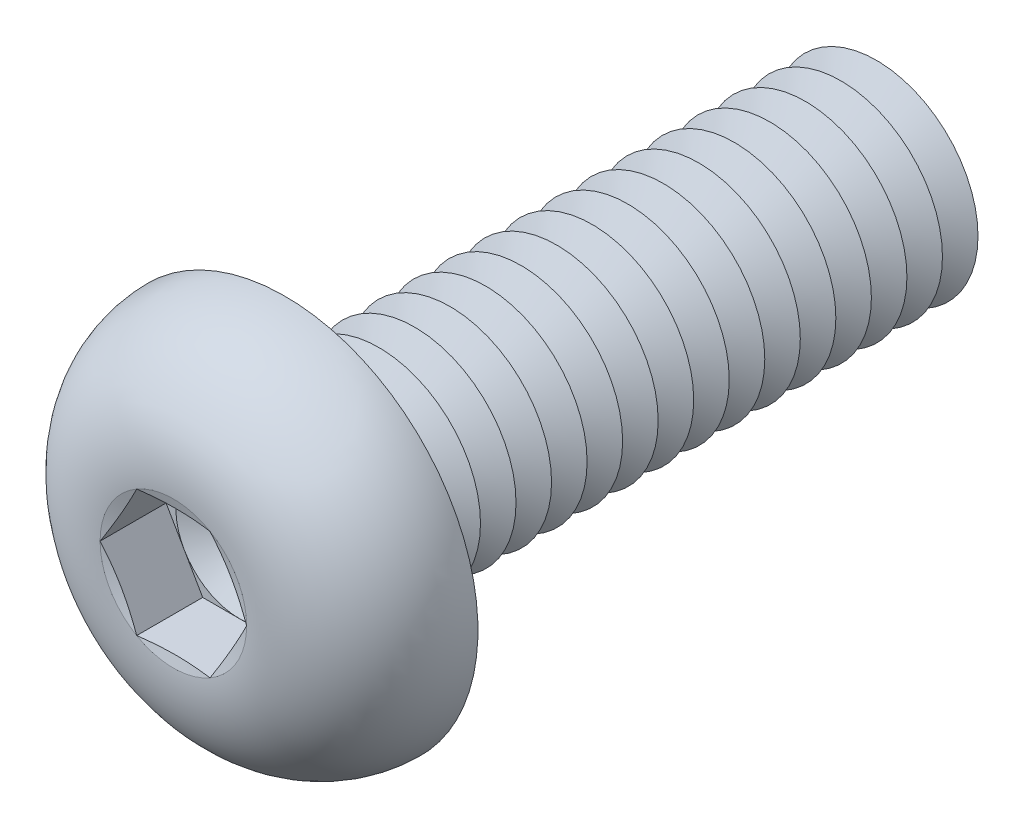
ISO-10303-21;
HEADER;
FILE_DESCRIPTION(('STEP AP214'),'2;1');
FILE_NAME('part.step','',(''),(''),'','','');
FILE_SCHEMA(('AUTOMOTIVE_DESIGN { 1 0 10303 214 1 1 1 1 }'));
ENDSEC;
DATA;
#1=APPLICATION_CONTEXT('core data for automotive mechanical design processes');
#2=APPLICATION_PROTOCOL_DEFINITION('international standard','automotive_design',2000,#1);
#3=PRODUCT_CONTEXT('',#1,'mechanical');
#4=PRODUCT('Part','Part','',(#3));
#5=PRODUCT_RELATED_PRODUCT_CATEGORY('part','',(#4));
#6=PRODUCT_DEFINITION_FORMATION('','',#4);
#7=PRODUCT_DEFINITION_CONTEXT('part definition',#1,'design');
#8=PRODUCT_DEFINITION('design','',#6,#7);
#9=PRODUCT_DEFINITION_SHAPE('','',#8);
#10=(LENGTH_UNIT() NAMED_UNIT(*) SI_UNIT(.MILLI.,.METRE.));
#11=(NAMED_UNIT(*) PLANE_ANGLE_UNIT() SI_UNIT($,.RADIAN.));
#12=(NAMED_UNIT(*) SI_UNIT($,.STERADIAN.) SOLID_ANGLE_UNIT());
#13=UNCERTAINTY_MEASURE_WITH_UNIT(LENGTH_MEASURE(1.E-05),#10,'distance_accuracy_value','');
#14=(GEOMETRIC_REPRESENTATION_CONTEXT(3) GLOBAL_UNCERTAINTY_ASSIGNED_CONTEXT((#13)) GLOBAL_UNIT_ASSIGNED_CONTEXT((#10,
#11,#12)) REPRESENTATION_CONTEXT('',''));
#15=CARTESIAN_POINT('',(0.,0.,0.));
#16=DIRECTION('',(0.,0.,1.));
#17=DIRECTION('',(1.,0.,0.));
#18=AXIS2_PLACEMENT_3D('',#15,#16,#17);
#19=CARTESIAN_POINT('',(0.,0.,0.9));
#20=DIRECTION('',(0.,0.,1.));
#21=DIRECTION('',(1.,0.,0.));
#22=AXIS2_PLACEMENT_3D('',#19,#20,#21);
#23=PLANE('',#22);
#24=CARTESIAN_POINT('',(0.,0.,0.9));
#25=DIRECTION('',(0.,0.,1.));
#26=DIRECTION('',(1.,0.,0.));
#27=AXIS2_PLACEMENT_3D('',#24,#25,#26);
#28=CIRCLE('',#27,1.24999941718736);
#29=CARTESIAN_POINT('',(1.08253125,0.624999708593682,0.9));
#30=VERTEX_POINT('',#29);
#31=CARTESIAN_POINT('',(0.,1.24999941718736,0.9));
#32=VERTEX_POINT('',#31);
#33=EDGE_CURVE('E118',#30,#32,#28,.T.);
#34=ORIENTED_EDGE('',*,*,#33,.F.);
#35=DIRECTION('',(-0.5,0.866025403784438,0.));
#36=VECTOR('',#35,1.);
#37=CARTESIAN_POINT('',(1.443375,0.,0.9));
#38=LINE('',#37,#36);
#39=CARTESIAN_POINT('',(0.7216875,1.24999941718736,0.9));
#40=VERTEX_POINT('',#39);
#41=EDGE_CURVE('E125',#30,#40,#38,.T.);
#42=ORIENTED_EDGE('',*,*,#41,.T.);
#43=DIRECTION('',(-1.,0.,0.));
#44=VECTOR('',#43,1.);
#45=CARTESIAN_POINT('',(0.7216875,1.24999941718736,0.9));
#46=LINE('',#45,#44);
#47=EDGE_CURVE('E136',#40,#32,#46,.T.);
#48=ORIENTED_EDGE('',*,*,#47,.T.);
#49=EDGE_LOOP('',(#34,#42,#48));
#50=FACE_BOUND('',#49,.T.);
#51=ADVANCED_FACE('F39',(#50),#23,.T.);
#52=CARTESIAN_POINT('',(0.,0.,0.9));
#53=DIRECTION('',(0.,0.,1.));
#54=DIRECTION('',(1.,0.,0.));
#55=AXIS2_PLACEMENT_3D('',#52,#53,#54);
#56=CIRCLE('',#55,1.24999941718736);
#57=CARTESIAN_POINT('',(-1.08253125,0.624999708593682,0.9));
#58=VERTEX_POINT('',#57);
#59=EDGE_CURVE('E11',#32,#58,#56,.T.);
#60=ORIENTED_EDGE('',*,*,#59,.F.);
#61=CARTESIAN_POINT('',(-0.721687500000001,1.24999941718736,0.9));
#62=VERTEX_POINT('',#61);
#63=EDGE_CURVE('E131',#32,#62,#46,.T.);
#64=ORIENTED_EDGE('',*,*,#63,.T.);
#65=DIRECTION('',(-0.5,-0.866025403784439,0.));
#66=VECTOR('',#65,1.);
#67=CARTESIAN_POINT('',(-0.721687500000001,1.24999941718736,0.9));
#68=LINE('',#67,#66);
#69=EDGE_CURVE('E134',#62,#58,#68,.T.);
#70=ORIENTED_EDGE('',*,*,#69,.T.);
#71=EDGE_LOOP('',(#60,#64,#70));
#72=FACE_BOUND('',#71,.T.);
#73=ADVANCED_FACE('F130',(#72),#23,.T.);
#74=CARTESIAN_POINT('',(-1.08253125,-0.624999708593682,0.9));
#75=VERTEX_POINT('',#74);
#76=EDGE_CURVE('E49',#58,#75,#56,.T.);
#77=ORIENTED_EDGE('',*,*,#76,.F.);
#78=CARTESIAN_POINT('',(-1.443375,0.,0.9));
#79=VERTEX_POINT('',#78);
#80=EDGE_CURVE('E143',#58,#79,#68,.T.);
#81=ORIENTED_EDGE('',*,*,#80,.T.);
#82=DIRECTION('',(0.5,-0.866025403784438,0.));
#83=VECTOR('',#82,1.);
#84=CARTESIAN_POINT('',(-1.443375,0.,0.9));
#85=LINE('',#84,#83);
#86=EDGE_CURVE('E151',#79,#75,#85,.T.);
#87=ORIENTED_EDGE('',*,*,#86,.T.);
#88=EDGE_LOOP('',(#77,#81,#87));
#89=FACE_BOUND('',#88,.T.);
#90=ADVANCED_FACE('F408',(#89),#23,.T.);
#91=CARTESIAN_POINT('',(0.,-1.24999941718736,0.9));
#92=VERTEX_POINT('',#91);
#93=EDGE_CURVE('E392',#75,#92,#56,.T.);
#94=ORIENTED_EDGE('',*,*,#93,.F.);
#95=CARTESIAN_POINT('',(-0.721687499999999,-1.24999941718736,0.9));
#96=VERTEX_POINT('',#95);
#97=EDGE_CURVE('E150',#75,#96,#85,.T.);
#98=ORIENTED_EDGE('',*,*,#97,.T.);
#99=DIRECTION('',(1.,0.,0.));
#100=VECTOR('',#99,1.);
#101=CARTESIAN_POINT('',(-0.721687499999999,-1.24999941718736,0.9));
#102=LINE('',#101,#100);
#103=EDGE_CURVE('E156',#96,#92,#102,.T.);
#104=ORIENTED_EDGE('',*,*,#103,.T.);
#105=EDGE_LOOP('',(#94,#98,#104));
#106=FACE_BOUND('',#105,.T.);
#107=ADVANCED_FACE('F402',(#106),#23,.T.);
#108=CARTESIAN_POINT('',(1.08253125,-0.624999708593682,0.9));
#109=VERTEX_POINT('',#108);
#110=EDGE_CURVE('E56',#92,#109,#56,.T.);
#111=ORIENTED_EDGE('',*,*,#110,.F.);
#112=CARTESIAN_POINT('',(0.721687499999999,-1.24999941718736,0.9));
#113=VERTEX_POINT('',#112);
#114=EDGE_CURVE('E155',#92,#113,#102,.T.);
#115=ORIENTED_EDGE('',*,*,#114,.T.);
#116=DIRECTION('',(0.5,0.866025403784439,0.));
#117=VECTOR('',#116,1.);
#118=CARTESIAN_POINT('',(0.721687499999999,-1.24999941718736,0.9));
#119=LINE('',#118,#117);
#120=EDGE_CURVE('E161',#113,#109,#119,.T.);
#121=ORIENTED_EDGE('',*,*,#120,.T.);
#122=EDGE_LOOP('',(#111,#115,#121));
#123=FACE_BOUND('',#122,.T.);
#124=ADVANCED_FACE('F450',(#123),#23,.T.);
#125=CARTESIAN_POINT('',(0.,0.,2.2));
#126=DIRECTION('',(0.,0.,1.));
#127=DIRECTION('',(1.,0.,0.));
#128=AXIS2_PLACEMENT_3D('',#125,#126,#127);
#129=CONICAL_SURFACE('',#128,1.443375,1.30899693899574);
#130=CARTESIAN_POINT('',(1.44349047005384,-0.000199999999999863,2.20003094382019));
#131=CARTESIAN_POINT('',(1.41351104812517,0.0517258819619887,2.19199301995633));
#132=CARTESIAN_POINT('',(1.38347725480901,0.10374593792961,2.18469579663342));
#133=CARTESIAN_POINT('',(1.32330355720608,0.207969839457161,2.17187512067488));
#134=CARTESIAN_POINT('',(1.29316361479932,0.260173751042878,2.16635238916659));
#135=CARTESIAN_POINT('',(1.23296043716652,0.364448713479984,2.15740323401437));
#136=CARTESIAN_POINT('',(1.20289760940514,0.416519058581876,2.15396613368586));
#137=CARTESIAN_POINT('',(1.14273359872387,0.520726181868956,2.14935732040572));
#138=CARTESIAN_POINT('',(1.11263242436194,0.572862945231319,2.14818516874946));
#139=CARTESIAN_POINT('',(1.05243007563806,0.677136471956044,2.14818516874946));
#140=CARTESIAN_POINT('',(1.02232890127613,0.729273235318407,2.14935732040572));
#141=CARTESIAN_POINT('',(0.962164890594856,0.833480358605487,2.15396613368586));
#142=CARTESIAN_POINT('',(0.932102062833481,0.885550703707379,2.15740323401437));
#143=CARTESIAN_POINT('',(0.87189888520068,0.989825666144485,2.16635238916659));
#144=CARTESIAN_POINT('',(0.841758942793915,1.0420295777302,2.17187512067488));
#145=CARTESIAN_POINT('',(0.781585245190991,1.14625347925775,2.18469579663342));
#146=CARTESIAN_POINT('',(0.751551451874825,1.19827353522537,2.19199301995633));
#147=CARTESIAN_POINT('',(0.721572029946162,1.25019941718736,2.20003094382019));
#148=B_SPLINE_CURVE_WITH_KNOTS('',3,(#130,#131,#132,#133,#134,#135,#136,#137,#138,#139,#140,
#141,#142,#143,#144,#145,#146,#147),.UNSPECIFIED.,.F.,.F.,(4,2,2,2,2,2,2,2,4),(0.,
0.181495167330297,0.363063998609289,0.543695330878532,0.724291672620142,0.904888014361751,
1.08551934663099,1.26708817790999,1.44858334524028),.UNSPECIFIED.);
#149=CARTESIAN_POINT('',(1.443375,0.,2.2));
#150=VERTEX_POINT('',#149);
#151=CARTESIAN_POINT('',(0.721687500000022,1.24999941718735,2.2));
#152=VERTEX_POINT('',#151);
#153=EDGE_CURVE('E221',#150,#152,#148,.T.);
#154=ORIENTED_EDGE('',*,*,#153,.F.);
#155=CARTESIAN_POINT('',(0.,0.,2.2));
#156=DIRECTION('',(0.,0.,-1.));
#157=DIRECTION('',(-1.,0.,0.));
#158=AXIS2_PLACEMENT_3D('',#155,#156,#157);
#159=CIRCLE('',#158,1.443375);
#160=EDGE_CURVE('E438',#152,#150,#159,.T.);
#161=ORIENTED_EDGE('',*,*,#160,.F.);
#162=EDGE_LOOP('',(#154,#161));
#163=FACE_BOUND('',#162,.T.);
#164=ADVANCED_FACE('F489',(#163),#129,.F.);
#165=CARTESIAN_POINT('',(0.721572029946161,-1.25019941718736,2.20003094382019));
#166=CARTESIAN_POINT('',(0.751551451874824,-1.19827353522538,2.19199301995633));
#167=CARTESIAN_POINT('',(0.78158524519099,-1.14625347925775,2.18469579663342));
#168=CARTESIAN_POINT('',(0.841758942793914,-1.0420295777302,2.17187512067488));
#169=CARTESIAN_POINT('',(0.87189888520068,-0.989825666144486,2.16635238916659));
#170=CARTESIAN_POINT('',(0.932102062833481,-0.88555070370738,2.15740323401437));
#171=CARTESIAN_POINT('',(0.962164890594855,-0.833480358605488,2.15396613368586));
#172=CARTESIAN_POINT('',(1.02232890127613,-0.729273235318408,2.14935732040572));
#173=CARTESIAN_POINT('',(1.05243007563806,-0.677136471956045,2.14818516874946));
#174=CARTESIAN_POINT('',(1.11263242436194,-0.572862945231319,2.14818516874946));
#175=CARTESIAN_POINT('',(1.14273359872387,-0.520726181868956,2.14935732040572));
#176=CARTESIAN_POINT('',(1.20289760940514,-0.416519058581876,2.15396613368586));
#177=CARTESIAN_POINT('',(1.23296043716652,-0.364448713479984,2.15740323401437));
#178=CARTESIAN_POINT('',(1.29316361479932,-0.260173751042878,2.16635238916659));
#179=CARTESIAN_POINT('',(1.32330355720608,-0.207969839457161,2.17187512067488));
#180=CARTESIAN_POINT('',(1.38347725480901,-0.10374593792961,2.18469579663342));
#181=CARTESIAN_POINT('',(1.41351104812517,-0.0517258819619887,2.19199301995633));
#182=CARTESIAN_POINT('',(1.44349047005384,0.000199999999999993,2.20003094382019));
#183=B_SPLINE_CURVE_WITH_KNOTS('',3,(#165,#166,#167,#168,#169,#170,#171,#172,#173,#174,#175,
#176,#177,#178,#179,#180,#181,#182),.UNSPECIFIED.,.F.,.F.,(4,2,2,2,2,2,2,2,4),(0.,
0.181495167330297,0.36306399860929,0.543695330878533,0.724291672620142,0.904888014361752,
1.085519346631,1.26708817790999,1.44858334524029),.UNSPECIFIED.);
#184=CARTESIAN_POINT('',(0.721687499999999,-1.24999941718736,2.2));
#185=VERTEX_POINT('',#184);
#186=EDGE_CURVE('E230',#185,#150,#183,.T.);
#187=ORIENTED_EDGE('',*,*,#186,.F.);
#188=EDGE_CURVE('E440',#150,#185,#159,.T.);
#189=ORIENTED_EDGE('',*,*,#188,.F.);
#190=EDGE_LOOP('',(#187,#189));
#191=FACE_BOUND('',#190,.T.);
#192=ADVANCED_FACE('F494',(#191),#129,.F.);
#193=CARTESIAN_POINT('',(-2.17815859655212,-1.24999941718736,2.48616275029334));
#194=CARTESIAN_POINT('',(-2.07269794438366,-1.24999941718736,2.4616881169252));
#195=CARTESIAN_POINT('',(-1.96714913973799,-1.24999941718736,2.43756889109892));
#196=CARTESIAN_POINT('',(-1.75576352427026,-1.24999941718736,2.39052699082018));
#197=CARTESIAN_POINT('',(-1.64992665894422,-1.24999941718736,2.36760456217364));
#198=CARTESIAN_POINT('',(-1.43690237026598,-1.24999941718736,2.3232454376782));
#199=CARTESIAN_POINT('',(-1.32971158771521,-1.24999941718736,2.30182468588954));
#200=CARTESIAN_POINT('',(-1.1148274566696,-1.24999941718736,2.26156703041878));
#201=CARTESIAN_POINT('',(-1.00713406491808,-1.24999941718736,2.24273035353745));
#202=CARTESIAN_POINT('',(-0.794044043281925,-1.24999941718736,2.2093913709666));
#203=CARTESIAN_POINT('',(-0.688664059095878,-1.24999941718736,2.19478562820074));
#204=CARTESIAN_POINT('',(-0.477310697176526,-1.24999941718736,2.17085809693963));
#205=CARTESIAN_POINT('',(-0.371337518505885,-1.24999941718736,2.16153463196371));
#206=CARTESIAN_POINT('',(-0.159455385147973,-1.24999941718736,2.14976770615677));
#207=CARTESIAN_POINT('',(-0.0535482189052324,-1.24999941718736,2.14729400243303));
#208=CARTESIAN_POINT('',(0.158189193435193,-1.24999941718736,2.14966287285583));
#209=CARTESIAN_POINT('',(0.264019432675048,-1.24999941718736,2.15450603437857));
#210=CARTESIAN_POINT('',(0.445148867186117,-1.24999941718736,2.16825380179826));
#211=CARTESIAN_POINT('',(0.520574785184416,-1.24999941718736,2.17561242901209));
#212=CARTESIAN_POINT('',(0.671115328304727,-1.24999941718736,2.19297000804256));
#213=CARTESIAN_POINT('',(0.746229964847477,-1.24999941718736,2.20296886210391));
#214=CARTESIAN_POINT('',(0.896387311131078,-1.24999941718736,2.22505910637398));
#215=CARTESIAN_POINT('',(0.971429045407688,-1.24999941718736,2.23715700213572));
#216=CARTESIAN_POINT('',(1.12124320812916,-1.24999941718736,2.26292371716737));
#217=CARTESIAN_POINT('',(1.19601562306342,-1.24999941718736,2.27659261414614));
#218=CARTESIAN_POINT('',(1.34686913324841,-1.24999941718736,2.30540811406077));
#219=CARTESIAN_POINT('',(1.42294548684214,-1.24999941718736,2.32057934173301));
#220=CARTESIAN_POINT('',(1.57490676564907,-1.24999941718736,2.351851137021));
#221=CARTESIAN_POINT('',(1.65079168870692,-1.24999941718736,2.36795171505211));
#222=CARTESIAN_POINT('',(1.80199501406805,-1.24999941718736,2.40076814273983));
#223=CARTESIAN_POINT('',(1.87731425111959,-1.24999941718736,2.41748016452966));
#224=CARTESIAN_POINT('',(2.02782424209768,-1.24999941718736,2.45144971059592));
#225=CARTESIAN_POINT('',(2.10301500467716,-1.24999941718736,2.46870719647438));
#226=CARTESIAN_POINT('',(2.17815859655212,-1.24999941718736,2.48616275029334));
#227=B_SPLINE_CURVE_WITH_KNOTS('',3,(#193,#194,#195,#196,#197,#198,#199,#200,#201,#202,#203,
#204,#205,#206,#207,#208,#209,#210,#211,#212,#213,#214,#215,#216,#217,#218,#219,#220,#221,#222,
#223,#224,#225,#226),.UNSPECIFIED.,.F.,.F.,(4,2,2,2,2,2,2,2,2,2,2,2,2,2,2,2,4),(0.,
0.324797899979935,0.649662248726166,0.977572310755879,1.30551113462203,1.62458166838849,
1.94355087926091,2.26110952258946,2.57869365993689,2.80599541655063,3.03328875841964,
3.2612995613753,3.48932164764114,3.7220371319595,3.95475522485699,4.18620606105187,
4.41764064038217),.UNSPECIFIED.);
#228=CARTESIAN_POINT('',(-0.721687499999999,-1.24999941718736,2.2));
#229=VERTEX_POINT('',#228);
#230=EDGE_CURVE('E420',#229,#185,#227,.T.);
#231=ORIENTED_EDGE('',*,*,#230,.F.);
#232=EDGE_CURVE('E428',#185,#229,#159,.T.);
#233=ORIENTED_EDGE('',*,*,#232,.F.);
#234=EDGE_LOOP('',(#231,#233));
#235=FACE_BOUND('',#234,.T.);
#236=ADVANCED_FACE('F548',(#235),#129,.F.);
#237=CARTESIAN_POINT('',(-1.44349047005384,0.000200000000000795,2.20003094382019));
#238=CARTESIAN_POINT('',(-1.41351104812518,-0.0517258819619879,2.19199301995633));
#239=CARTESIAN_POINT('',(-1.38347725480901,-0.10374593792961,2.18469579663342));
#240=CARTESIAN_POINT('',(-1.32330355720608,-0.20796983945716,2.17187512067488));
#241=CARTESIAN_POINT('',(-1.29316361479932,-0.260173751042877,2.16635238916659));
#242=CARTESIAN_POINT('',(-1.23296043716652,-0.364448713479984,2.15740323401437));
#243=CARTESIAN_POINT('',(-1.20289760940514,-0.416519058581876,2.15396613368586));
#244=CARTESIAN_POINT('',(-1.14273359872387,-0.520726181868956,2.14935732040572));
#245=CARTESIAN_POINT('',(-1.11263242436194,-0.572862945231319,2.14818516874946));
#246=CARTESIAN_POINT('',(-1.05243007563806,-0.677136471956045,2.14818516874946));
#247=CARTESIAN_POINT('',(-1.02232890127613,-0.729273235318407,2.14935732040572));
#248=CARTESIAN_POINT('',(-0.962164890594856,-0.833480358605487,2.15396613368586));
#249=CARTESIAN_POINT('',(-0.932102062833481,-0.885550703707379,2.15740323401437));
#250=CARTESIAN_POINT('',(-0.87189888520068,-0.989825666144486,2.16635238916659));
#251=CARTESIAN_POINT('',(-0.841758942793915,-1.0420295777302,2.17187512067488));
#252=CARTESIAN_POINT('',(-0.78158524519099,-1.14625347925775,2.18469579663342));
#253=CARTESIAN_POINT('',(-0.751551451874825,-1.19827353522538,2.19199301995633));
#254=CARTESIAN_POINT('',(-0.721572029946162,-1.25019941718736,2.20003094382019));
#255=B_SPLINE_CURVE_WITH_KNOTS('',3,(#237,#238,#239,#240,#241,#242,#243,#244,#245,#246,#247,
#248,#249,#250,#251,#252,#253,#254),.UNSPECIFIED.,.F.,.F.,(4,2,2,2,2,2,2,2,4),(0.,
0.181495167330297,0.36306399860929,0.543695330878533,0.724291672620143,0.904888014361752,
1.085519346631,1.26708817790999,1.44858334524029),.UNSPECIFIED.);
#256=CARTESIAN_POINT('',(-1.443375,0.,2.2));
#257=VERTEX_POINT('',#256);
#258=EDGE_CURVE('E413',#257,#229,#255,.T.);
#259=ORIENTED_EDGE('',*,*,#258,.F.);
#260=EDGE_CURVE('E371',#229,#257,#159,.T.);
#261=ORIENTED_EDGE('',*,*,#260,.F.);
#262=EDGE_LOOP('',(#259,#261));
#263=FACE_BOUND('',#262,.T.);
#264=ADVANCED_FACE('F417',(#263),#129,.F.);
#265=CARTESIAN_POINT('',(-0.721572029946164,1.25019941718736,2.20003094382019));
#266=CARTESIAN_POINT('',(-0.751551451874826,1.19827353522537,2.19199301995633));
#267=CARTESIAN_POINT('',(-0.781585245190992,1.14625347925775,2.18469579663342));
#268=CARTESIAN_POINT('',(-0.841758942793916,1.0420295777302,2.17187512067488));
#269=CARTESIAN_POINT('',(-0.871898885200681,0.989825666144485,2.16635238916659));
#270=CARTESIAN_POINT('',(-0.932102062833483,0.885550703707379,2.15740323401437));
#271=CARTESIAN_POINT('',(-0.962164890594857,0.833480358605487,2.15396613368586));
#272=CARTESIAN_POINT('',(-1.02232890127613,0.729273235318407,2.14935732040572));
#273=CARTESIAN_POINT('',(-1.05243007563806,0.677136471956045,2.14818516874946));
#274=CARTESIAN_POINT('',(-1.11263242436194,0.572862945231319,2.14818516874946));
#275=CARTESIAN_POINT('',(-1.14273359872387,0.520726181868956,2.14935732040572));
#276=CARTESIAN_POINT('',(-1.20289760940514,0.416519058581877,2.15396613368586));
#277=CARTESIAN_POINT('',(-1.23296043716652,0.364448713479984,2.15740323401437));
#278=CARTESIAN_POINT('',(-1.29316361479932,0.260173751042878,2.16635238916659));
#279=CARTESIAN_POINT('',(-1.32330355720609,0.207969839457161,2.17187512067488));
#280=CARTESIAN_POINT('',(-1.38347725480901,0.103745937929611,2.18469579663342));
#281=CARTESIAN_POINT('',(-1.41351104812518,0.0517258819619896,2.19199301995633));
#282=CARTESIAN_POINT('',(-1.44349047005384,-0.00019999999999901,2.20003094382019));
#283=B_SPLINE_CURVE_WITH_KNOTS('',3,(#265,#266,#267,#268,#269,#270,#271,#272,#273,#274,#275,
#276,#277,#278,#279,#280,#281,#282),.UNSPECIFIED.,.F.,.F.,(4,2,2,2,2,2,2,2,4),(0.,
0.181495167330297,0.363063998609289,0.543695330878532,0.724291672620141,0.90488801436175,
1.08551934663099,1.26708817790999,1.44858334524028),.UNSPECIFIED.);
#284=CARTESIAN_POINT('',(-0.721687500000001,1.24999941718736,2.2));
#285=VERTEX_POINT('',#284);
#286=EDGE_CURVE('E194',#285,#257,#283,.T.);
#287=ORIENTED_EDGE('',*,*,#286,.F.);
#288=EDGE_CURVE('E372',#257,#285,#159,.T.);
#289=ORIENTED_EDGE('',*,*,#288,.F.);
#290=EDGE_LOOP('',(#287,#289));
#291=FACE_BOUND('',#290,.T.);
#292=ADVANCED_FACE('F430',(#291),#129,.F.);
#293=CARTESIAN_POINT('',(0.,0.,-9.55));
#294=DIRECTION('',(0.,0.,1.));
#295=DIRECTION('',(1.,0.,0.));
#296=AXIS2_PLACEMENT_3D('',#293,#294,#295);
#297=CONICAL_SURFACE('',#296,2.00000000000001,1.0471975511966);
#298=CARTESIAN_POINT('',(0.,0.,-9.9));
#299=DIRECTION('',(0.,0.,1.));
#300=DIRECTION('',(1.,0.,0.));
#301=AXIS2_PLACEMENT_3D('',#298,#299,#300);
#302=CIRCLE('',#301,1.3937822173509);
#303=CARTESIAN_POINT('',(1.3937822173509,0.,-9.9));
#304=VERTEX_POINT('',#303);
#305=EDGE_CURVE('E343',#304,#304,#302,.T.);
#306=ORIENTED_EDGE('',*,*,#305,.T.);
#307=EDGE_LOOP('',(#306));
#308=FACE_BOUND('',#307,.T.);
#309=CARTESIAN_POINT('',(0.,0.,-9.55));
#310=DIRECTION('',(0.,0.,1.));
#311=DIRECTION('',(1.,0.,0.));
#312=AXIS2_PLACEMENT_3D('',#309,#310,#311);
#313=CIRCLE('',#312,2.00000000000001);
#314=CARTESIAN_POINT('',(2.00000000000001,0.,-9.55));
#315=VERTEX_POINT('',#314);
#316=EDGE_CURVE('E339',#315,#315,#313,.T.);
#317=ORIENTED_EDGE('',*,*,#316,.F.);
#318=EDGE_LOOP('',(#317));
#319=FACE_BOUND('',#318,.T.);
#320=ADVANCED_FACE('F538',(#308,#319),#297,.T.);
#321=CARTESIAN_POINT('',(0.,0.,-9.9));
#322=DIRECTION('',(0.,0.,-1.));
#323=DIRECTION('',(-1.,0.,0.));
#324=AXIS2_PLACEMENT_3D('',#321,#322,#323);
#325=CONICAL_SURFACE('',#324,1.3937822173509,1.0471975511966);
#326=CARTESIAN_POINT('',(0.,0.,-10.25));
#327=DIRECTION('',(0.,0.,1.));
#328=DIRECTION('',(1.,0.,0.));
#329=AXIS2_PLACEMENT_3D('',#326,#327,#328);
#330=CIRCLE('',#329,2.00000000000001);
#331=CARTESIAN_POINT('',(2.00000000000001,0.,-10.25));
#332=VERTEX_POINT('',#331);
#333=EDGE_CURVE('E347',#332,#332,#330,.T.);
#334=ORIENTED_EDGE('',*,*,#333,.T.);
#335=EDGE_LOOP('',(#334));
#336=FACE_BOUND('',#335,.T.);
#337=ORIENTED_EDGE('',*,*,#305,.F.);
#338=EDGE_LOOP('',(#337));
#339=FACE_BOUND('',#338,.T.);
#340=ADVANCED_FACE('F884',(#336,#339),#325,.T.);
#341=CARTESIAN_POINT('',(0.,2.00000000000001,-12.));
#342=DIRECTION('',(0.,0.,-1.));
#343=DIRECTION('',(-1.,0.,0.));
#344=AXIS2_PLACEMENT_3D('',#341,#342,#343);
#345=PLANE('',#344);
#346=CARTESIAN_POINT('',(0.,0.,-12.));
#347=DIRECTION('',(0.,0.,1.));
#348=DIRECTION('',(1.,0.,0.));
#349=AXIS2_PLACEMENT_3D('',#346,#347,#348);
#350=CIRCLE('',#349,1.3937822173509);
#351=CARTESIAN_POINT('',(1.3937822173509,0.,-12.));
#352=VERTEX_POINT('',#351);
#353=EDGE_CURVE('E367',#352,#352,#350,.T.);
#354=ORIENTED_EDGE('',*,*,#353,.F.);
#355=EDGE_LOOP('',(#354));
#356=FACE_BOUND('',#355,.T.);
#357=ADVANCED_FACE('F889',(#356),#345,.T.);
#358=CARTESIAN_POINT('',(0.,0.,-11.65));
#359=DIRECTION('',(0.,0.,1.));
#360=DIRECTION('',(1.,0.,0.));
#361=AXIS2_PLACEMENT_3D('',#358,#359,#360);
#362=CONICAL_SURFACE('',#361,2.00000000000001,1.0471975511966);
#363=ORIENTED_EDGE('',*,*,#353,.T.);
#364=EDGE_LOOP('',(#363));
#365=FACE_BOUND('',#364,.T.);
#366=CARTESIAN_POINT('',(0.,0.,-11.65));
#367=DIRECTION('',(0.,0.,1.));
#368=DIRECTION('',(1.,0.,0.));
#369=AXIS2_PLACEMENT_3D('',#366,#367,#368);
#370=CIRCLE('',#369,2.00000000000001);
#371=CARTESIAN_POINT('',(2.00000000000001,0.,-11.65));
#372=VERTEX_POINT('',#371);
#373=EDGE_CURVE('E363',#372,#372,#370,.T.);
#374=ORIENTED_EDGE('',*,*,#373,.F.);
#375=EDGE_LOOP('',(#374));
#376=FACE_BOUND('',#375,.T.);
#377=ADVANCED_FACE('F877',(#365,#376),#362,.T.);
#378=CARTESIAN_POINT('',(0.,0.,-11.3));
#379=DIRECTION('',(0.,0.,-1.));
#380=DIRECTION('',(-1.,0.,0.));
#381=AXIS2_PLACEMENT_3D('',#378,#379,#380);
#382=CONICAL_SURFACE('',#381,1.3937822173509,1.0471975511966);
#383=ORIENTED_EDGE('',*,*,#373,.T.);
#384=EDGE_LOOP('',(#383));
#385=FACE_BOUND('',#384,.T.);
#386=CARTESIAN_POINT('',(0.,0.,-11.3));
#387=DIRECTION('',(0.,0.,1.));
#388=DIRECTION('',(1.,0.,0.));
#389=AXIS2_PLACEMENT_3D('',#386,#387,#388);
#390=CIRCLE('',#389,1.3937822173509);
#391=CARTESIAN_POINT('',(1.3937822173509,0.,-11.3));
#392=VERTEX_POINT('',#391);
#393=EDGE_CURVE('E359',#392,#392,#390,.T.);
#394=ORIENTED_EDGE('',*,*,#393,.F.);
#395=EDGE_LOOP('',(#394));
#396=FACE_BOUND('',#395,.T.);
#397=ADVANCED_FACE('F867',(#385,#396),#382,.T.);
#398=CARTESIAN_POINT('',(0.,0.,-10.95));
#399=DIRECTION('',(0.,0.,1.));
#400=DIRECTION('',(1.,0.,0.));
#401=AXIS2_PLACEMENT_3D('',#398,#399,#400);
#402=CONICAL_SURFACE('',#401,2.00000000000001,1.0471975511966);
#403=ORIENTED_EDGE('',*,*,#393,.T.);
#404=EDGE_LOOP('',(#403));
#405=FACE_BOUND('',#404,.T.);
#406=CARTESIAN_POINT('',(0.,0.,-10.95));
#407=DIRECTION('',(0.,0.,1.));
#408=DIRECTION('',(1.,0.,0.));
#409=AXIS2_PLACEMENT_3D('',#406,#407,#408);
#410=CIRCLE('',#409,2.00000000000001);
#411=CARTESIAN_POINT('',(2.00000000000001,0.,-10.95));
#412=VERTEX_POINT('',#411);
#413=EDGE_CURVE('E355',#412,#412,#410,.T.);
#414=ORIENTED_EDGE('',*,*,#413,.F.);
#415=EDGE_LOOP('',(#414));
#416=FACE_BOUND('',#415,.T.);
#417=ADVANCED_FACE('F857',(#405,#416),#402,.T.);
#418=CARTESIAN_POINT('',(0.,0.,-10.6));
#419=DIRECTION('',(0.,0.,-1.));
#420=DIRECTION('',(-1.,0.,0.));
#421=AXIS2_PLACEMENT_3D('',#418,#419,#420);
#422=CONICAL_SURFACE('',#421,1.3937822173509,1.0471975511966);
#423=ORIENTED_EDGE('',*,*,#413,.T.);
#424=EDGE_LOOP('',(#423));
#425=FACE_BOUND('',#424,.T.);
#426=CARTESIAN_POINT('',(0.,0.,-10.6));
#427=DIRECTION('',(0.,0.,1.));
#428=DIRECTION('',(1.,0.,0.));
#429=AXIS2_PLACEMENT_3D('',#426,#427,#428);
#430=CIRCLE('',#429,1.3937822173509);
#431=CARTESIAN_POINT('',(1.3937822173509,0.,-10.6));
#432=VERTEX_POINT('',#431);
#433=EDGE_CURVE('E351',#432,#432,#430,.T.);
#434=ORIENTED_EDGE('',*,*,#433,.F.);
#435=EDGE_LOOP('',(#434));
#436=FACE_BOUND('',#435,.T.);
#437=ADVANCED_FACE('F847',(#425,#436),#422,.T.);
#438=CARTESIAN_POINT('',(0.,0.,-10.25));
#439=DIRECTION('',(0.,0.,1.));
#440=DIRECTION('',(1.,0.,0.));
#441=AXIS2_PLACEMENT_3D('',#438,#439,#440);
#442=CONICAL_SURFACE('',#441,2.00000000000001,1.0471975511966);
#443=ORIENTED_EDGE('',*,*,#433,.T.);
#444=EDGE_LOOP('',(#443));
#445=FACE_BOUND('',#444,.T.);
#446=ORIENTED_EDGE('',*,*,#333,.F.);
#447=EDGE_LOOP('',(#446));
#448=FACE_BOUND('',#447,.T.);
#449=ADVANCED_FACE('F837',(#445,#448),#442,.T.);
#450=CARTESIAN_POINT('',(0.,0.,-8.85));
#451=DIRECTION('',(0.,0.,1.));
#452=DIRECTION('',(1.,0.,0.));
#453=AXIS2_PLACEMENT_3D('',#450,#451,#452);
#454=CONICAL_SURFACE('',#453,2.00000000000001,1.0471975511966);
#455=CARTESIAN_POINT('',(0.,0.,-9.2));
#456=DIRECTION('',(0.,0.,1.));
#457=DIRECTION('',(1.,0.,0.));
#458=AXIS2_PLACEMENT_3D('',#455,#456,#457);
#459=CIRCLE('',#458,1.3937822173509);
#460=CARTESIAN_POINT('',(1.3937822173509,0.,-9.2));
#461=VERTEX_POINT('',#460);
#462=EDGE_CURVE('E335',#461,#461,#459,.T.);
#463=ORIENTED_EDGE('',*,*,#462,.T.);
#464=EDGE_LOOP('',(#463));
#465=FACE_BOUND('',#464,.T.);
#466=CARTESIAN_POINT('',(0.,0.,-8.85));
#467=DIRECTION('',(0.,0.,1.));
#468=DIRECTION('',(1.,0.,0.));
#469=AXIS2_PLACEMENT_3D('',#466,#467,#468);
#470=CIRCLE('',#469,2.00000000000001);
#471=CARTESIAN_POINT('',(2.00000000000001,0.,-8.85));
#472=VERTEX_POINT('',#471);
#473=EDGE_CURVE('E331',#472,#472,#470,.T.);
#474=ORIENTED_EDGE('',*,*,#473,.F.);
#475=EDGE_LOOP('',(#474));
#476=FACE_BOUND('',#475,.T.);
#477=ADVANCED_FACE('F827',(#465,#476),#454,.T.);
#478=CARTESIAN_POINT('',(0.,0.,-9.2));
#479=DIRECTION('',(0.,0.,-1.));
#480=DIRECTION('',(-1.,0.,0.));
#481=AXIS2_PLACEMENT_3D('',#478,#479,#480);
#482=CONICAL_SURFACE('',#481,1.3937822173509,1.0471975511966);
#483=ORIENTED_EDGE('',*,*,#316,.T.);
#484=EDGE_LOOP('',(#483));
#485=FACE_BOUND('',#484,.T.);
#486=ORIENTED_EDGE('',*,*,#462,.F.);
#487=EDGE_LOOP('',(#486));
#488=FACE_BOUND('',#487,.T.);
#489=ADVANCED_FACE('F817',(#485,#488),#482,.T.);
#490=CARTESIAN_POINT('',(0.,0.,-8.15));
#491=DIRECTION('',(0.,0.,1.));
#492=DIRECTION('',(1.,0.,0.));
#493=AXIS2_PLACEMENT_3D('',#490,#491,#492);
#494=CONICAL_SURFACE('',#493,2.00000000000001,1.0471975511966);
#495=CARTESIAN_POINT('',(0.,0.,-8.5));
#496=DIRECTION('',(0.,0.,1.));
#497=DIRECTION('',(1.,0.,0.));
#498=AXIS2_PLACEMENT_3D('',#495,#496,#497);
#499=CIRCLE('',#498,1.3937822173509);
#500=CARTESIAN_POINT('',(1.3937822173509,0.,-8.5));
#501=VERTEX_POINT('',#500);
#502=EDGE_CURVE('E327',#501,#501,#499,.T.);
#503=ORIENTED_EDGE('',*,*,#502,.T.);
#504=EDGE_LOOP('',(#503));
#505=FACE_BOUND('',#504,.T.);
#506=CARTESIAN_POINT('',(0.,0.,-8.15));
#507=DIRECTION('',(0.,0.,1.));
#508=DIRECTION('',(1.,0.,0.));
#509=AXIS2_PLACEMENT_3D('',#506,#507,#508);
#510=CIRCLE('',#509,2.00000000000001);
#511=CARTESIAN_POINT('',(2.00000000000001,0.,-8.15));
#512=VERTEX_POINT('',#511);
#513=EDGE_CURVE('E323',#512,#512,#510,.T.);
#514=ORIENTED_EDGE('',*,*,#513,.F.);
#515=EDGE_LOOP('',(#514));
#516=FACE_BOUND('',#515,.T.);
#517=ADVANCED_FACE('F807',(#505,#516),#494,.T.);
#518=CARTESIAN_POINT('',(0.,0.,-8.5));
#519=DIRECTION('',(0.,0.,-1.));
#520=DIRECTION('',(-1.,0.,0.));
#521=AXIS2_PLACEMENT_3D('',#518,#519,#520);
#522=CONICAL_SURFACE('',#521,1.3937822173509,1.0471975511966);
#523=ORIENTED_EDGE('',*,*,#473,.T.);
#524=EDGE_LOOP('',(#523));
#525=FACE_BOUND('',#524,.T.);
#526=ORIENTED_EDGE('',*,*,#502,.F.);
#527=EDGE_LOOP('',(#526));
#528=FACE_BOUND('',#527,.T.);
#529=ADVANCED_FACE('F797',(#525,#528),#522,.T.);
#530=CARTESIAN_POINT('',(0.,0.,-7.45));
#531=DIRECTION('',(0.,0.,1.));
#532=DIRECTION('',(1.,0.,0.));
#533=AXIS2_PLACEMENT_3D('',#530,#531,#532);
#534=CONICAL_SURFACE('',#533,2.00000000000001,1.0471975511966);
#535=CARTESIAN_POINT('',(0.,0.,-7.8));
#536=DIRECTION('',(0.,0.,1.));
#537=DIRECTION('',(1.,0.,0.));
#538=AXIS2_PLACEMENT_3D('',#535,#536,#537);
#539=CIRCLE('',#538,1.3937822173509);
#540=CARTESIAN_POINT('',(1.3937822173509,0.,-7.8));
#541=VERTEX_POINT('',#540);
#542=EDGE_CURVE('E319',#541,#541,#539,.T.);
#543=ORIENTED_EDGE('',*,*,#542,.T.);
#544=EDGE_LOOP('',(#543));
#545=FACE_BOUND('',#544,.T.);
#546=CARTESIAN_POINT('',(0.,0.,-7.45));
#547=DIRECTION('',(0.,0.,1.));
#548=DIRECTION('',(1.,0.,0.));
#549=AXIS2_PLACEMENT_3D('',#546,#547,#548);
#550=CIRCLE('',#549,2.00000000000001);
#551=CARTESIAN_POINT('',(2.00000000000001,0.,-7.45));
#552=VERTEX_POINT('',#551);
#553=EDGE_CURVE('E315',#552,#552,#550,.T.);
#554=ORIENTED_EDGE('',*,*,#553,.F.);
#555=EDGE_LOOP('',(#554));
#556=FACE_BOUND('',#555,.T.);
#557=ADVANCED_FACE('F787',(#545,#556),#534,.T.);
#558=CARTESIAN_POINT('',(0.,0.,-7.8));
#559=DIRECTION('',(0.,0.,-1.));
#560=DIRECTION('',(-1.,0.,0.));
#561=AXIS2_PLACEMENT_3D('',#558,#559,#560);
#562=CONICAL_SURFACE('',#561,1.3937822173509,1.0471975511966);
#563=ORIENTED_EDGE('',*,*,#513,.T.);
#564=EDGE_LOOP('',(#563));
#565=FACE_BOUND('',#564,.T.);
#566=ORIENTED_EDGE('',*,*,#542,.F.);
#567=EDGE_LOOP('',(#566));
#568=FACE_BOUND('',#567,.T.);
#569=ADVANCED_FACE('F777',(#565,#568),#562,.T.);
#570=CARTESIAN_POINT('',(0.,0.,-6.75));
#571=DIRECTION('',(0.,0.,1.));
#572=DIRECTION('',(1.,0.,0.));
#573=AXIS2_PLACEMENT_3D('',#570,#571,#572);
#574=CONICAL_SURFACE('',#573,2.00000000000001,1.0471975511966);
#575=CARTESIAN_POINT('',(0.,0.,-7.1));
#576=DIRECTION('',(0.,0.,1.));
#577=DIRECTION('',(1.,0.,0.));
#578=AXIS2_PLACEMENT_3D('',#575,#576,#577);
#579=CIRCLE('',#578,1.3937822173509);
#580=CARTESIAN_POINT('',(1.3937822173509,0.,-7.1));
#581=VERTEX_POINT('',#580);
#582=EDGE_CURVE('E311',#581,#581,#579,.T.);
#583=ORIENTED_EDGE('',*,*,#582,.T.);
#584=EDGE_LOOP('',(#583));
#585=FACE_BOUND('',#584,.T.);
#586=CARTESIAN_POINT('',(0.,0.,-6.75));
#587=DIRECTION('',(0.,0.,1.));
#588=DIRECTION('',(1.,0.,0.));
#589=AXIS2_PLACEMENT_3D('',#586,#587,#588);
#590=CIRCLE('',#589,2.00000000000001);
#591=CARTESIAN_POINT('',(2.00000000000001,0.,-6.75));
#592=VERTEX_POINT('',#591);
#593=EDGE_CURVE('E307',#592,#592,#590,.T.);
#594=ORIENTED_EDGE('',*,*,#593,.F.);
#595=EDGE_LOOP('',(#594));
#596=FACE_BOUND('',#595,.T.);
#597=ADVANCED_FACE('F767',(#585,#596),#574,.T.);
#598=CARTESIAN_POINT('',(0.,0.,-7.1));
#599=DIRECTION('',(0.,0.,-1.));
#600=DIRECTION('',(-1.,0.,0.));
#601=AXIS2_PLACEMENT_3D('',#598,#599,#600);
#602=CONICAL_SURFACE('',#601,1.3937822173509,1.0471975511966);
#603=ORIENTED_EDGE('',*,*,#553,.T.);
#604=EDGE_LOOP('',(#603));
#605=FACE_BOUND('',#604,.T.);
#606=ORIENTED_EDGE('',*,*,#582,.F.);
#607=EDGE_LOOP('',(#606));
#608=FACE_BOUND('',#607,.T.);
#609=ADVANCED_FACE('F757',(#605,#608),#602,.T.);
#610=CARTESIAN_POINT('',(0.,0.,-6.05));
#611=DIRECTION('',(0.,0.,1.));
#612=DIRECTION('',(1.,0.,0.));
#613=AXIS2_PLACEMENT_3D('',#610,#611,#612);
#614=CONICAL_SURFACE('',#613,2.00000000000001,1.0471975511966);
#615=CARTESIAN_POINT('',(0.,0.,-6.4));
#616=DIRECTION('',(0.,0.,1.));
#617=DIRECTION('',(1.,0.,0.));
#618=AXIS2_PLACEMENT_3D('',#615,#616,#617);
#619=CIRCLE('',#618,1.3937822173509);
#620=CARTESIAN_POINT('',(1.3937822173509,0.,-6.4));
#621=VERTEX_POINT('',#620);
#622=EDGE_CURVE('E303',#621,#621,#619,.T.);
#623=ORIENTED_EDGE('',*,*,#622,.T.);
#624=EDGE_LOOP('',(#623));
#625=FACE_BOUND('',#624,.T.);
#626=CARTESIAN_POINT('',(0.,0.,-6.05));
#627=DIRECTION('',(0.,0.,1.));
#628=DIRECTION('',(1.,0.,0.));
#629=AXIS2_PLACEMENT_3D('',#626,#627,#628);
#630=CIRCLE('',#629,2.00000000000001);
#631=CARTESIAN_POINT('',(2.00000000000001,0.,-6.05));
#632=VERTEX_POINT('',#631);
#633=EDGE_CURVE('E299',#632,#632,#630,.T.);
#634=ORIENTED_EDGE('',*,*,#633,.F.);
#635=EDGE_LOOP('',(#634));
#636=FACE_BOUND('',#635,.T.);
#637=ADVANCED_FACE('F747',(#625,#636),#614,.T.);
#638=CARTESIAN_POINT('',(0.,0.,-6.4));
#639=DIRECTION('',(0.,0.,-1.));
#640=DIRECTION('',(-1.,0.,0.));
#641=AXIS2_PLACEMENT_3D('',#638,#639,#640);
#642=CONICAL_SURFACE('',#641,1.3937822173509,1.0471975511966);
#643=ORIENTED_EDGE('',*,*,#593,.T.);
#644=EDGE_LOOP('',(#643));
#645=FACE_BOUND('',#644,.T.);
#646=ORIENTED_EDGE('',*,*,#622,.F.);
#647=EDGE_LOOP('',(#646));
#648=FACE_BOUND('',#647,.T.);
#649=ADVANCED_FACE('F737',(#645,#648),#642,.T.);
#650=CARTESIAN_POINT('',(0.,0.,-5.35));
#651=DIRECTION('',(0.,0.,1.));
#652=DIRECTION('',(1.,0.,0.));
#653=AXIS2_PLACEMENT_3D('',#650,#651,#652);
#654=CONICAL_SURFACE('',#653,2.00000000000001,1.0471975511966);
#655=CARTESIAN_POINT('',(0.,0.,-5.7));
#656=DIRECTION('',(0.,0.,1.));
#657=DIRECTION('',(1.,0.,0.));
#658=AXIS2_PLACEMENT_3D('',#655,#656,#657);
#659=CIRCLE('',#658,1.3937822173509);
#660=CARTESIAN_POINT('',(1.3937822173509,0.,-5.7));
#661=VERTEX_POINT('',#660);
#662=EDGE_CURVE('E295',#661,#661,#659,.T.);
#663=ORIENTED_EDGE('',*,*,#662,.T.);
#664=EDGE_LOOP('',(#663));
#665=FACE_BOUND('',#664,.T.);
#666=CARTESIAN_POINT('',(0.,0.,-5.35));
#667=DIRECTION('',(0.,0.,1.));
#668=DIRECTION('',(1.,0.,0.));
#669=AXIS2_PLACEMENT_3D('',#666,#667,#668);
#670=CIRCLE('',#669,2.00000000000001);
#671=CARTESIAN_POINT('',(2.00000000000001,0.,-5.35));
#672=VERTEX_POINT('',#671);
#673=EDGE_CURVE('E291',#672,#672,#670,.T.);
#674=ORIENTED_EDGE('',*,*,#673,.F.);
#675=EDGE_LOOP('',(#674));
#676=FACE_BOUND('',#675,.T.);
#677=ADVANCED_FACE('F727',(#665,#676),#654,.T.);
#678=CARTESIAN_POINT('',(0.,0.,-5.7));
#679=DIRECTION('',(0.,0.,-1.));
#680=DIRECTION('',(-1.,0.,0.));
#681=AXIS2_PLACEMENT_3D('',#678,#679,#680);
#682=CONICAL_SURFACE('',#681,1.3937822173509,1.0471975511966);
#683=ORIENTED_EDGE('',*,*,#633,.T.);
#684=EDGE_LOOP('',(#683));
#685=FACE_BOUND('',#684,.T.);
#686=ORIENTED_EDGE('',*,*,#662,.F.);
#687=EDGE_LOOP('',(#686));
#688=FACE_BOUND('',#687,.T.);
#689=ADVANCED_FACE('F717',(#685,#688),#682,.T.);
#690=CARTESIAN_POINT('',(0.,0.,-4.65));
#691=DIRECTION('',(0.,0.,1.));
#692=DIRECTION('',(1.,0.,0.));
#693=AXIS2_PLACEMENT_3D('',#690,#691,#692);
#694=CONICAL_SURFACE('',#693,2.00000000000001,1.0471975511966);
#695=CARTESIAN_POINT('',(0.,0.,-5.));
#696=DIRECTION('',(0.,0.,1.));
#697=DIRECTION('',(1.,0.,0.));
#698=AXIS2_PLACEMENT_3D('',#695,#696,#697);
#699=CIRCLE('',#698,1.3937822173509);
#700=CARTESIAN_POINT('',(1.3937822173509,0.,-5.));
#701=VERTEX_POINT('',#700);
#702=EDGE_CURVE('E287',#701,#701,#699,.T.);
#703=ORIENTED_EDGE('',*,*,#702,.T.);
#704=EDGE_LOOP('',(#703));
#705=FACE_BOUND('',#704,.T.);
#706=CARTESIAN_POINT('',(0.,0.,-4.65));
#707=DIRECTION('',(0.,0.,1.));
#708=DIRECTION('',(1.,0.,0.));
#709=AXIS2_PLACEMENT_3D('',#706,#707,#708);
#710=CIRCLE('',#709,2.00000000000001);
#711=CARTESIAN_POINT('',(2.00000000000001,0.,-4.65));
#712=VERTEX_POINT('',#711);
#713=EDGE_CURVE('E283',#712,#712,#710,.T.);
#714=ORIENTED_EDGE('',*,*,#713,.F.);
#715=EDGE_LOOP('',(#714));
#716=FACE_BOUND('',#715,.T.);
#717=ADVANCED_FACE('F707',(#705,#716),#694,.T.);
#718=CARTESIAN_POINT('',(0.,0.,-5.));
#719=DIRECTION('',(0.,0.,-1.));
#720=DIRECTION('',(-1.,0.,0.));
#721=AXIS2_PLACEMENT_3D('',#718,#719,#720);
#722=CONICAL_SURFACE('',#721,1.3937822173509,1.0471975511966);
#723=ORIENTED_EDGE('',*,*,#673,.T.);
#724=EDGE_LOOP('',(#723));
#725=FACE_BOUND('',#724,.T.);
#726=ORIENTED_EDGE('',*,*,#702,.F.);
#727=EDGE_LOOP('',(#726));
#728=FACE_BOUND('',#727,.T.);
#729=ADVANCED_FACE('F697',(#725,#728),#722,.T.);
#730=CARTESIAN_POINT('',(0.,0.,-3.95));
#731=DIRECTION('',(0.,0.,1.));
#732=DIRECTION('',(1.,0.,0.));
#733=AXIS2_PLACEMENT_3D('',#730,#731,#732);
#734=CONICAL_SURFACE('',#733,2.00000000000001,1.0471975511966);
#735=CARTESIAN_POINT('',(0.,0.,-4.3));
#736=DIRECTION('',(0.,0.,1.));
#737=DIRECTION('',(1.,0.,0.));
#738=AXIS2_PLACEMENT_3D('',#735,#736,#737);
#739=CIRCLE('',#738,1.3937822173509);
#740=CARTESIAN_POINT('',(1.3937822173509,0.,-4.3));
#741=VERTEX_POINT('',#740);
#742=EDGE_CURVE('E279',#741,#741,#739,.T.);
#743=ORIENTED_EDGE('',*,*,#742,.T.);
#744=EDGE_LOOP('',(#743));
#745=FACE_BOUND('',#744,.T.);
#746=CARTESIAN_POINT('',(0.,0.,-3.95));
#747=DIRECTION('',(0.,0.,1.));
#748=DIRECTION('',(1.,0.,0.));
#749=AXIS2_PLACEMENT_3D('',#746,#747,#748);
#750=CIRCLE('',#749,2.00000000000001);
#751=CARTESIAN_POINT('',(2.00000000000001,0.,-3.95));
#752=VERTEX_POINT('',#751);
#753=EDGE_CURVE('E275',#752,#752,#750,.T.);
#754=ORIENTED_EDGE('',*,*,#753,.F.);
#755=EDGE_LOOP('',(#754));
#756=FACE_BOUND('',#755,.T.);
#757=ADVANCED_FACE('F687',(#745,#756),#734,.T.);
#758=CARTESIAN_POINT('',(0.,0.,-4.3));
#759=DIRECTION('',(0.,0.,-1.));
#760=DIRECTION('',(-1.,0.,0.));
#761=AXIS2_PLACEMENT_3D('',#758,#759,#760);
#762=CONICAL_SURFACE('',#761,1.3937822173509,1.0471975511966);
#763=ORIENTED_EDGE('',*,*,#713,.T.);
#764=EDGE_LOOP('',(#763));
#765=FACE_BOUND('',#764,.T.);
#766=ORIENTED_EDGE('',*,*,#742,.F.);
#767=EDGE_LOOP('',(#766));
#768=FACE_BOUND('',#767,.T.);
#769=ADVANCED_FACE('F677',(#765,#768),#762,.T.);
#770=CARTESIAN_POINT('',(0.,0.,-3.25));
#771=DIRECTION('',(0.,0.,1.));
#772=DIRECTION('',(1.,0.,0.));
#773=AXIS2_PLACEMENT_3D('',#770,#771,#772);
#774=CONICAL_SURFACE('',#773,2.00000000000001,1.0471975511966);
#775=CARTESIAN_POINT('',(0.,0.,-3.6));
#776=DIRECTION('',(0.,0.,1.));
#777=DIRECTION('',(1.,0.,0.));
#778=AXIS2_PLACEMENT_3D('',#775,#776,#777);
#779=CIRCLE('',#778,1.3937822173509);
#780=CARTESIAN_POINT('',(1.3937822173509,0.,-3.6));
#781=VERTEX_POINT('',#780);
#782=EDGE_CURVE('E271',#781,#781,#779,.T.);
#783=ORIENTED_EDGE('',*,*,#782,.T.);
#784=EDGE_LOOP('',(#783));
#785=FACE_BOUND('',#784,.T.);
#786=CARTESIAN_POINT('',(0.,0.,-3.25));
#787=DIRECTION('',(0.,0.,1.));
#788=DIRECTION('',(1.,0.,0.));
#789=AXIS2_PLACEMENT_3D('',#786,#787,#788);
#790=CIRCLE('',#789,2.00000000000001);
#791=CARTESIAN_POINT('',(2.00000000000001,0.,-3.25));
#792=VERTEX_POINT('',#791);
#793=EDGE_CURVE('E267',#792,#792,#790,.T.);
#794=ORIENTED_EDGE('',*,*,#793,.F.);
#795=EDGE_LOOP('',(#794));
#796=FACE_BOUND('',#795,.T.);
#797=ADVANCED_FACE('F667',(#785,#796),#774,.T.);
#798=CARTESIAN_POINT('',(0.,0.,-3.6));
#799=DIRECTION('',(0.,0.,-1.));
#800=DIRECTION('',(-1.,0.,0.));
#801=AXIS2_PLACEMENT_3D('',#798,#799,#800);
#802=CONICAL_SURFACE('',#801,1.3937822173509,1.0471975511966);
#803=ORIENTED_EDGE('',*,*,#753,.T.);
#804=EDGE_LOOP('',(#803));
#805=FACE_BOUND('',#804,.T.);
#806=ORIENTED_EDGE('',*,*,#782,.F.);
#807=EDGE_LOOP('',(#806));
#808=FACE_BOUND('',#807,.T.);
#809=ADVANCED_FACE('F657',(#805,#808),#802,.T.);
#810=CARTESIAN_POINT('',(0.,0.,-2.55));
#811=DIRECTION('',(0.,0.,1.));
#812=DIRECTION('',(1.,0.,0.));
#813=AXIS2_PLACEMENT_3D('',#810,#811,#812);
#814=CONICAL_SURFACE('',#813,2.00000000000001,1.0471975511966);
#815=CARTESIAN_POINT('',(0.,0.,-2.9));
#816=DIRECTION('',(0.,0.,1.));
#817=DIRECTION('',(1.,0.,0.));
#818=AXIS2_PLACEMENT_3D('',#815,#816,#817);
#819=CIRCLE('',#818,1.3937822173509);
#820=CARTESIAN_POINT('',(1.3937822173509,0.,-2.9));
#821=VERTEX_POINT('',#820);
#822=EDGE_CURVE('E263',#821,#821,#819,.T.);
#823=ORIENTED_EDGE('',*,*,#822,.T.);
#824=EDGE_LOOP('',(#823));
#825=FACE_BOUND('',#824,.T.);
#826=CARTESIAN_POINT('',(0.,0.,-2.55));
#827=DIRECTION('',(0.,0.,1.));
#828=DIRECTION('',(1.,0.,0.));
#829=AXIS2_PLACEMENT_3D('',#826,#827,#828);
#830=CIRCLE('',#829,2.00000000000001);
#831=CARTESIAN_POINT('',(2.00000000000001,0.,-2.55));
#832=VERTEX_POINT('',#831);
#833=EDGE_CURVE('E260',#832,#832,#830,.T.);
#834=ORIENTED_EDGE('',*,*,#833,.F.);
#835=EDGE_LOOP('',(#834));
#836=FACE_BOUND('',#835,.T.);
#837=ADVANCED_FACE('F647',(#825,#836),#814,.T.);
#838=CARTESIAN_POINT('',(0.,0.,-2.9));
#839=DIRECTION('',(0.,0.,-1.));
#840=DIRECTION('',(-1.,0.,0.));
#841=AXIS2_PLACEMENT_3D('',#838,#839,#840);
#842=CONICAL_SURFACE('',#841,1.3937822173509,1.0471975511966);
#843=ORIENTED_EDGE('',*,*,#793,.T.);
#844=EDGE_LOOP('',(#843));
#845=FACE_BOUND('',#844,.T.);
#846=ORIENTED_EDGE('',*,*,#822,.F.);
#847=EDGE_LOOP('',(#846));
#848=FACE_BOUND('',#847,.T.);
#849=ADVANCED_FACE('F637',(#845,#848),#842,.T.);
#850=CARTESIAN_POINT('',(0.,0.,-1.85));
#851=DIRECTION('',(0.,0.,1.));
#852=DIRECTION('',(1.,0.,0.));
#853=AXIS2_PLACEMENT_3D('',#850,#851,#852);
#854=CONICAL_SURFACE('',#853,2.00000000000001,1.0471975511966);
#855=CARTESIAN_POINT('',(0.,0.,-2.2));
#856=DIRECTION('',(0.,0.,1.));
#857=DIRECTION('',(1.,0.,0.));
#858=AXIS2_PLACEMENT_3D('',#855,#856,#857);
#859=CIRCLE('',#858,1.3937822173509);
#860=CARTESIAN_POINT('',(1.3937822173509,0.,-2.2));
#861=VERTEX_POINT('',#860);
#862=EDGE_CURVE('E256',#861,#861,#859,.T.);
#863=ORIENTED_EDGE('',*,*,#862,.T.);
#864=EDGE_LOOP('',(#863));
#865=FACE_BOUND('',#864,.T.);
#866=CARTESIAN_POINT('',(0.,0.,-1.85));
#867=DIRECTION('',(0.,0.,1.));
#868=DIRECTION('',(1.,0.,0.));
#869=AXIS2_PLACEMENT_3D('',#866,#867,#868);
#870=CIRCLE('',#869,2.00000000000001);
#871=CARTESIAN_POINT('',(2.00000000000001,0.,-1.85));
#872=VERTEX_POINT('',#871);
#873=EDGE_CURVE('E252',#872,#872,#870,.T.);
#874=ORIENTED_EDGE('',*,*,#873,.F.);
#875=EDGE_LOOP('',(#874));
#876=FACE_BOUND('',#875,.T.);
#877=ADVANCED_FACE('F627',(#865,#876),#854,.T.);
#878=CARTESIAN_POINT('',(0.,0.,-2.2));
#879=DIRECTION('',(0.,0.,-1.));
#880=DIRECTION('',(-1.,0.,0.));
#881=AXIS2_PLACEMENT_3D('',#878,#879,#880);
#882=CONICAL_SURFACE('',#881,1.3937822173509,1.0471975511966);
#883=ORIENTED_EDGE('',*,*,#833,.T.);
#884=EDGE_LOOP('',(#883));
#885=FACE_BOUND('',#884,.T.);
#886=ORIENTED_EDGE('',*,*,#862,.F.);
#887=EDGE_LOOP('',(#886));
#888=FACE_BOUND('',#887,.T.);
#889=ADVANCED_FACE('F617',(#885,#888),#882,.T.);
#890=CARTESIAN_POINT('',(0.,0.,-1.15));
#891=DIRECTION('',(0.,0.,1.));
#892=DIRECTION('',(1.,0.,0.));
#893=AXIS2_PLACEMENT_3D('',#890,#891,#892);
#894=CONICAL_SURFACE('',#893,2.00000000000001,1.0471975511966);
#895=CARTESIAN_POINT('',(0.,0.,-1.5));
#896=DIRECTION('',(0.,0.,1.));
#897=DIRECTION('',(1.,0.,0.));
#898=AXIS2_PLACEMENT_3D('',#895,#896,#897);
#899=CIRCLE('',#898,1.3937822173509);
#900=CARTESIAN_POINT('',(1.3937822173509,0.,-1.5));
#901=VERTEX_POINT('',#900);
#902=EDGE_CURVE('E248',#901,#901,#899,.T.);
#903=ORIENTED_EDGE('',*,*,#902,.T.);
#904=EDGE_LOOP('',(#903));
#905=FACE_BOUND('',#904,.T.);
#906=CARTESIAN_POINT('',(0.,0.,-1.15));
#907=DIRECTION('',(0.,0.,1.));
#908=DIRECTION('',(1.,0.,0.));
#909=AXIS2_PLACEMENT_3D('',#906,#907,#908);
#910=CIRCLE('',#909,2.00000000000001);
#911=CARTESIAN_POINT('',(2.00000000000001,0.,-1.15));
#912=VERTEX_POINT('',#911);
#913=EDGE_CURVE('E240',#912,#912,#910,.T.);
#914=ORIENTED_EDGE('',*,*,#913,.F.);
#915=EDGE_LOOP('',(#914));
#916=FACE_BOUND('',#915,.T.);
#917=ADVANCED_FACE('F607',(#905,#916),#894,.T.);
#918=CARTESIAN_POINT('',(0.,0.,-1.5));
#919=DIRECTION('',(0.,0.,-1.));
#920=DIRECTION('',(-1.,0.,0.));
#921=AXIS2_PLACEMENT_3D('',#918,#919,#920);
#922=CONICAL_SURFACE('',#921,1.3937822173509,1.0471975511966);
#923=ORIENTED_EDGE('',*,*,#873,.T.);
#924=EDGE_LOOP('',(#923));
#925=FACE_BOUND('',#924,.T.);
#926=ORIENTED_EDGE('',*,*,#902,.F.);
#927=EDGE_LOOP('',(#926));
#928=FACE_BOUND('',#927,.T.);
#929=ADVANCED_FACE('F598',(#925,#928),#922,.T.);
#930=CARTESIAN_POINT('',(0.,0.,-0.450000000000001));
#931=DIRECTION('',(0.,0.,1.));
#932=DIRECTION('',(1.,0.,0.));
#933=AXIS2_PLACEMENT_3D('',#930,#931,#932);
#934=CONICAL_SURFACE('',#933,2.00000000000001,1.0471975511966);
#935=CARTESIAN_POINT('',(0.,0.,-0.8));
#936=DIRECTION('',(0.,0.,1.));
#937=DIRECTION('',(1.,0.,0.));
#938=AXIS2_PLACEMENT_3D('',#935,#936,#937);
#939=CIRCLE('',#938,1.3937822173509);
#940=CARTESIAN_POINT('',(1.3937822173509,0.,-0.8));
#941=VERTEX_POINT('',#940);
#942=EDGE_CURVE('E229',#941,#941,#939,.T.);
#943=ORIENTED_EDGE('',*,*,#942,.T.);
#944=EDGE_LOOP('',(#943));
#945=FACE_BOUND('',#944,.T.);
#946=CARTESIAN_POINT('',(0.,0.,-0.450000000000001));
#947=DIRECTION('',(0.,0.,1.));
#948=DIRECTION('',(1.,0.,0.));
#949=AXIS2_PLACEMENT_3D('',#946,#947,#948);
#950=CIRCLE('',#949,2.00000000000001);
#951=CARTESIAN_POINT('',(2.00000000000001,0.,-0.450000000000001));
#952=VERTEX_POINT('',#951);
#953=EDGE_CURVE('E244',#952,#952,#950,.T.);
#954=ORIENTED_EDGE('',*,*,#953,.F.);
#955=EDGE_LOOP('',(#954));
#956=FACE_BOUND('',#955,.T.);
#957=ADVANCED_FACE('F589',(#945,#956),#934,.T.);
#958=CARTESIAN_POINT('',(0.,0.,-0.8));
#959=DIRECTION('',(0.,0.,-1.));
#960=DIRECTION('',(-1.,0.,0.));
#961=AXIS2_PLACEMENT_3D('',#958,#959,#960);
#962=CONICAL_SURFACE('',#961,1.3937822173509,1.0471975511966);
#963=ORIENTED_EDGE('',*,*,#913,.T.);
#964=EDGE_LOOP('',(#963));
#965=FACE_BOUND('',#964,.T.);
#966=ORIENTED_EDGE('',*,*,#942,.F.);
#967=EDGE_LOOP('',(#966));
#968=FACE_BOUND('',#967,.T.);
#969=ADVANCED_FACE('F218',(#965,#968),#962,.T.);
#970=CARTESIAN_POINT('',(2.17815859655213,1.24999941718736,2.48616275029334));
#971=CARTESIAN_POINT('',(2.07269794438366,1.24999941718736,2.4616881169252));
#972=CARTESIAN_POINT('',(1.96714913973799,1.24999941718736,2.43756889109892));
#973=CARTESIAN_POINT('',(1.75576352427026,1.24999941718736,2.39052699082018));
#974=CARTESIAN_POINT('',(1.64992665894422,1.24999941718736,2.36760456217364));
#975=CARTESIAN_POINT('',(1.43690237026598,1.24999941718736,2.3232454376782));
#976=CARTESIAN_POINT('',(1.32971158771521,1.24999941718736,2.30182468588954));
#977=CARTESIAN_POINT('',(1.1148274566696,1.24999941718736,2.26156703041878));
#978=CARTESIAN_POINT('',(1.00713406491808,1.24999941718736,2.24273035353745));
#979=CARTESIAN_POINT('',(0.794044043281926,1.24999941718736,2.2093913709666));
#980=CARTESIAN_POINT('',(0.688664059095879,1.24999941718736,2.19478562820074));
#981=CARTESIAN_POINT('',(0.477310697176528,1.24999941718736,2.17085809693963));
#982=CARTESIAN_POINT('',(0.371337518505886,1.24999941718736,2.16153463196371));
#983=CARTESIAN_POINT('',(0.159455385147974,1.24999941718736,2.14976770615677));
#984=CARTESIAN_POINT('',(0.0535482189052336,1.24999941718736,2.14729400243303));
#985=CARTESIAN_POINT('',(-0.158189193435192,1.24999941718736,2.14966287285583));
#986=CARTESIAN_POINT('',(-0.264019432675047,1.24999941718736,2.15450603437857));
#987=CARTESIAN_POINT('',(-0.445148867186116,1.24999941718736,2.16825380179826));
#988=CARTESIAN_POINT('',(-0.520574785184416,1.24999941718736,2.17561242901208));
#989=CARTESIAN_POINT('',(-0.671115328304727,1.24999941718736,2.19297000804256));
#990=CARTESIAN_POINT('',(-0.746229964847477,1.24999941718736,2.20296886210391));
#991=CARTESIAN_POINT('',(-0.896387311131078,1.24999941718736,2.22505910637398));
#992=CARTESIAN_POINT('',(-0.971429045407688,1.24999941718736,2.23715700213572));
#993=CARTESIAN_POINT('',(-1.12124320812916,1.24999941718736,2.26292371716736));
#994=CARTESIAN_POINT('',(-1.19601562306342,1.24999941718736,2.27659261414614));
#995=CARTESIAN_POINT('',(-1.34686913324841,1.24999941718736,2.30540811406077));
#996=CARTESIAN_POINT('',(-1.42294548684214,1.24999941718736,2.32057934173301));
#997=CARTESIAN_POINT('',(-1.57490676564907,1.24999941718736,2.351851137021));
#998=CARTESIAN_POINT('',(-1.65079168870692,1.24999941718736,2.36795171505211));
#999=CARTESIAN_POINT('',(-1.80199501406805,1.24999941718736,2.40076814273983));
#1000=CARTESIAN_POINT('',(-1.87731425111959,1.24999941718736,2.41748016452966));
#1001=CARTESIAN_POINT('',(-2.02782424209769,1.24999941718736,2.45144971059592));
#1002=CARTESIAN_POINT('',(-2.10301500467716,1.24999941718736,2.46870719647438));
#1003=CARTESIAN_POINT('',(-2.17815859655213,1.24999941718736,2.48616275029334));
#1004=B_SPLINE_CURVE_WITH_KNOTS('',3,(#970,#971,#972,#973,#974,#975,#976,#977,#978,#979,#980,
#981,#982,#983,#984,#985,#986,#987,#988,#989,#990,#991,#992,#993,#994,#995,#996,#997,#998,#999,
#1000,#1001,#1002,#1003),.UNSPECIFIED.,.F.,.F.,(4,2,2,2,2,2,2,2,2,2,2,2,2,2,2,2,4),(0.,
0.324797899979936,0.649662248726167,0.97757231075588,1.30551113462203,1.62458166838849,
1.94355087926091,2.26110952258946,2.5786936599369,2.80599541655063,3.03328875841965,
3.2612995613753,3.48932164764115,3.7220371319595,3.95475522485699,4.18620606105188,
4.41764064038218),.UNSPECIFIED.);
#1005=EDGE_CURVE('E169',#152,#285,#1004,.T.);
#1006=ORIENTED_EDGE('',*,*,#1005,.F.);
#1007=EDGE_CURVE('E377',#285,#152,#159,.T.);
#1008=ORIENTED_EDGE('',*,*,#1007,.F.);
#1009=EDGE_LOOP('',(#1006,#1008));
#1010=FACE_BOUND('',#1009,.T.);
#1011=ADVANCED_FACE('F201',(#1010),#129,.F.);
#1012=CARTESIAN_POINT('',(0.,0.,0.));
#1013=DIRECTION('',(0.,0.,-1.));
#1014=DIRECTION('',(-1.,0.,0.));
#1015=AXIS2_PLACEMENT_3D('',#1012,#1013,#1014);
#1016=DEGENERATE_TOROIDAL_SURFACE('',#1015,1.59479522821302,2.20520477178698,.T.);
#1017=ORIENTED_EDGE('',*,*,#288,.T.);
#1018=ORIENTED_EDGE('',*,*,#1007,.T.);
#1019=ORIENTED_EDGE('',*,*,#160,.T.);
#1020=ORIENTED_EDGE('',*,*,#188,.T.);
#1021=ORIENTED_EDGE('',*,*,#232,.T.);
#1022=ORIENTED_EDGE('',*,*,#260,.T.);
#1023=EDGE_LOOP('',(#1017,#1018,#1019,#1020,#1021,#1022));
#1024=FACE_BOUND('',#1023,.T.);
#1025=CARTESIAN_POINT('',(0.,0.,0.));
#1026=DIRECTION('',(0.,0.,-1.));
#1027=DIRECTION('',(-1.,0.,0.));
#1028=AXIS2_PLACEMENT_3D('',#1025,#1026,#1027);
#1029=CIRCLE('',#1028,3.8);
#1030=CARTESIAN_POINT('',(-3.8,0.,0.));
#1031=VERTEX_POINT('',#1030);
#1032=EDGE_CURVE('E376',#1031,#1031,#1029,.T.);
#1033=ORIENTED_EDGE('',*,*,#1032,.F.);
#1034=EDGE_LOOP('',(#1033));
#1035=FACE_BOUND('',#1034,.T.);
#1036=ADVANCED_FACE('F423',(#1024,#1035),#1016,.T.);
#1037=CARTESIAN_POINT('',(0.,2.,0.));
#1038=DIRECTION('',(0.,0.,-1.));
#1039=DIRECTION('',(-1.,0.,0.));
#1040=AXIS2_PLACEMENT_3D('',#1037,#1038,#1039);
#1041=PLANE('',#1040);
#1042=CARTESIAN_POINT('',(0.,0.,0.));
#1043=DIRECTION('',(0.,0.,-1.));
#1044=DIRECTION('',(-1.,0.,0.));
#1045=AXIS2_PLACEMENT_3D('',#1042,#1043,#1044);
#1046=CIRCLE('',#1045,2.35);
#1047=CARTESIAN_POINT('',(-2.35,0.,0.));
#1048=VERTEX_POINT('',#1047);
#1049=EDGE_CURVE('E384',#1048,#1048,#1046,.F.);
#1050=ORIENTED_EDGE('',*,*,#1049,.T.);
#1051=EDGE_LOOP('',(#1050));
#1052=FACE_BOUND('',#1051,.T.);
#1053=ORIENTED_EDGE('',*,*,#1032,.T.);
#1054=EDGE_LOOP('',(#1053));
#1055=FACE_BOUND('',#1054,.T.);
#1056=ADVANCED_FACE('F519',(#1052,#1055),#1041,.T.);
#1057=CARTESIAN_POINT('',(0.,0.,-0.35));
#1058=DIRECTION('',(0.,0.,-1.));
#1059=DIRECTION('',(-1.,0.,0.));
#1060=AXIS2_PLACEMENT_3D('',#1057,#1058,#1059);
#1061=TOROIDAL_SURFACE('',#1060,2.35,0.35);
#1062=ORIENTED_EDGE('',*,*,#1049,.F.);
#1063=EDGE_LOOP('',(#1062));
#1064=FACE_BOUND('',#1063,.T.);
#1065=CARTESIAN_POINT('',(0.,0.,-0.35));
#1066=DIRECTION('',(0.,0.,-1.));
#1067=DIRECTION('',(-1.,0.,0.));
#1068=AXIS2_PLACEMENT_3D('',#1065,#1066,#1067);
#1069=CIRCLE('',#1068,2.);
#1070=CARTESIAN_POINT('',(-2.,0.,-0.35));
#1071=VERTEX_POINT('',#1070);
#1072=EDGE_CURVE('E381',#1071,#1071,#1069,.T.);
#1073=ORIENTED_EDGE('',*,*,#1072,.F.);
#1074=EDGE_LOOP('',(#1073));
#1075=FACE_BOUND('',#1074,.T.);
#1076=ADVANCED_FACE('F41',(#1064,#1075),#1061,.F.);
#1077=CARTESIAN_POINT('',(0.,0.,-12.));
#1078=DIRECTION('',(0.,0.,-1.));
#1079=DIRECTION('',(-1.,0.,0.));
#1080=AXIS2_PLACEMENT_3D('',#1077,#1078,#1079);
#1081=CYLINDRICAL_SURFACE('',#1080,2.);
#1082=ORIENTED_EDGE('',*,*,#1072,.T.);
#1083=EDGE_LOOP('',(#1082));
#1084=FACE_BOUND('',#1083,.T.);
#1085=ORIENTED_EDGE('',*,*,#953,.T.);
#1086=EDGE_LOOP('',(#1085));
#1087=FACE_BOUND('',#1086,.T.);
#1088=ADVANCED_FACE('F216',(#1084,#1087),#1081,.T.);
#1089=CARTESIAN_POINT('',(1.443375,0.,0.9));
#1090=DIRECTION('',(0.866025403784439,0.5,0.));
#1091=DIRECTION('',(-0.5,0.866025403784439,0.));
#1092=AXIS2_PLACEMENT_3D('',#1089,#1090,#1091);
#1093=PLANE('',#1092);
#1094=ORIENTED_EDGE('',*,*,#153,.T.);
#1095=DIRECTION('',(0.,0.,1.));
#1096=VECTOR('',#1095,1.);
#1097=CARTESIAN_POINT('',(0.7216875,1.24999941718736,0.9));
#1098=LINE('',#1097,#1096);
#1099=EDGE_CURVE('E64',#40,#152,#1098,.T.);
#1100=ORIENTED_EDGE('',*,*,#1099,.F.);
#1101=ORIENTED_EDGE('',*,*,#41,.F.);
#1102=CARTESIAN_POINT('',(1.443375,0.,0.9));
#1103=VERTEX_POINT('',#1102);
#1104=EDGE_CURVE('E140',#1103,#30,#38,.T.);
#1105=ORIENTED_EDGE('',*,*,#1104,.F.);
#1106=DIRECTION('',(0.,0.,1.));
#1107=VECTOR('',#1106,1.);
#1108=CARTESIAN_POINT('',(1.443375,0.,0.9));
#1109=LINE('',#1108,#1107);
#1110=EDGE_CURVE('E165',#1103,#150,#1109,.T.);
#1111=ORIENTED_EDGE('',*,*,#1110,.T.);
#1112=EDGE_LOOP('',(#1094,#1100,#1101,#1105,#1111));
#1113=FACE_BOUND('',#1112,.T.);
#1114=ADVANCED_FACE('F211',(#1113),#1093,.F.);
#1115=CARTESIAN_POINT('',(0.721687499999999,-1.24999941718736,0.9));
#1116=DIRECTION('',(0.866025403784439,-0.5,0.));
#1117=DIRECTION('',(0.5,0.866025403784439,0.));
#1118=AXIS2_PLACEMENT_3D('',#1115,#1116,#1117);
#1119=PLANE('',#1118);
#1120=ORIENTED_EDGE('',*,*,#186,.T.);
#1121=ORIENTED_EDGE('',*,*,#1110,.F.);
#1122=EDGE_CURVE('E160',#109,#1103,#119,.T.);
#1123=ORIENTED_EDGE('',*,*,#1122,.F.);
#1124=ORIENTED_EDGE('',*,*,#120,.F.);
#1125=DIRECTION('',(0.,0.,1.));
#1126=VECTOR('',#1125,1.);
#1127=CARTESIAN_POINT('',(0.721687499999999,-1.24999941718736,0.9));
#1128=LINE('',#1127,#1126);
#1129=EDGE_CURVE('E170',#113,#185,#1128,.T.);
#1130=ORIENTED_EDGE('',*,*,#1129,.T.);
#1131=EDGE_LOOP('',(#1120,#1121,#1123,#1124,#1130));
#1132=FACE_BOUND('',#1131,.T.);
#1133=ADVANCED_FACE('F215',(#1132),#1119,.F.);
#1134=CARTESIAN_POINT('',(-0.721687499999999,-1.24999941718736,0.9));
#1135=DIRECTION('',(0.,-1.,0.));
#1136=DIRECTION('',(1.,0.,0.));
#1137=AXIS2_PLACEMENT_3D('',#1134,#1135,#1136);
#1138=PLANE('',#1137);
#1139=ORIENTED_EDGE('',*,*,#230,.T.);
#1140=ORIENTED_EDGE('',*,*,#1129,.F.);
#1141=ORIENTED_EDGE('',*,*,#114,.F.);
#1142=ORIENTED_EDGE('',*,*,#103,.F.);
#1143=DIRECTION('',(0.,0.,1.));
#1144=VECTOR('',#1143,1.);
#1145=CARTESIAN_POINT('',(-0.721687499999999,-1.24999941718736,0.9));
#1146=LINE('',#1145,#1144);
#1147=EDGE_CURVE('E174',#96,#229,#1146,.T.);
#1148=ORIENTED_EDGE('',*,*,#1147,.T.);
#1149=EDGE_LOOP('',(#1139,#1140,#1141,#1142,#1148));
#1150=FACE_BOUND('',#1149,.T.);
#1151=ADVANCED_FACE('F453',(#1150),#1138,.F.);
#1152=CARTESIAN_POINT('',(-1.443375,0.,0.9));
#1153=DIRECTION('',(-0.866025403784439,-0.5,0.));
#1154=DIRECTION('',(0.5,-0.866025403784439,0.));
#1155=AXIS2_PLACEMENT_3D('',#1152,#1153,#1154);
#1156=PLANE('',#1155);
#1157=ORIENTED_EDGE('',*,*,#258,.T.);
#1158=ORIENTED_EDGE('',*,*,#1147,.F.);
#1159=ORIENTED_EDGE('',*,*,#97,.F.);
#1160=ORIENTED_EDGE('',*,*,#86,.F.);
#1161=DIRECTION('',(0.,0.,1.));
#1162=VECTOR('',#1161,1.);
#1163=CARTESIAN_POINT('',(-1.443375,0.,0.9));
#1164=LINE('',#1163,#1162);
#1165=EDGE_CURVE('E178',#79,#257,#1164,.T.);
#1166=ORIENTED_EDGE('',*,*,#1165,.T.);
#1167=EDGE_LOOP('',(#1157,#1158,#1159,#1160,#1166));
#1168=FACE_BOUND('',#1167,.T.);
#1169=ADVANCED_FACE('F407',(#1168),#1156,.F.);
#1170=CARTESIAN_POINT('',(-0.721687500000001,1.24999941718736,0.9));
#1171=DIRECTION('',(-0.866025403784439,0.5,0.));
#1172=DIRECTION('',(-0.5,-0.866025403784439,0.));
#1173=AXIS2_PLACEMENT_3D('',#1170,#1171,#1172);
#1174=PLANE('',#1173);
#1175=ORIENTED_EDGE('',*,*,#286,.T.);
#1176=ORIENTED_EDGE('',*,*,#1165,.F.);
#1177=ORIENTED_EDGE('',*,*,#80,.F.);
#1178=ORIENTED_EDGE('',*,*,#69,.F.);
#1179=DIRECTION('',(0.,0.,1.));
#1180=VECTOR('',#1179,1.);
#1181=CARTESIAN_POINT('',(-0.721687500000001,1.24999941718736,0.9));
#1182=LINE('',#1181,#1180);
#1183=EDGE_CURVE('E138',#62,#285,#1182,.T.);
#1184=ORIENTED_EDGE('',*,*,#1183,.T.);
#1185=EDGE_LOOP('',(#1175,#1176,#1177,#1178,#1184));
#1186=FACE_BOUND('',#1185,.T.);
#1187=ADVANCED_FACE('F208',(#1186),#1174,.F.);
#1188=CARTESIAN_POINT('',(0.7216875,1.24999941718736,0.9));
#1189=DIRECTION('',(0.,1.,0.));
#1190=DIRECTION('',(-1.,0.,0.));
#1191=AXIS2_PLACEMENT_3D('',#1188,#1189,#1190);
#1192=PLANE('',#1191);
#1193=ORIENTED_EDGE('',*,*,#1005,.T.);
#1194=ORIENTED_EDGE('',*,*,#1183,.F.);
#1195=ORIENTED_EDGE('',*,*,#63,.F.);
#1196=ORIENTED_EDGE('',*,*,#47,.F.);
#1197=ORIENTED_EDGE('',*,*,#1099,.T.);
#1198=EDGE_LOOP('',(#1193,#1194,#1195,#1196,#1197));
#1199=FACE_BOUND('',#1198,.T.);
#1200=ADVANCED_FACE('F135',(#1199),#1192,.F.);
#1201=EDGE_CURVE('E43',#109,#30,#56,.T.);
#1202=ORIENTED_EDGE('',*,*,#1201,.F.);
#1203=ORIENTED_EDGE('',*,*,#1122,.T.);
#1204=ORIENTED_EDGE('',*,*,#1104,.T.);
#1205=EDGE_LOOP('',(#1202,#1203,#1204));
#1206=FACE_BOUND('',#1205,.T.);
#1207=ADVANCED_FACE('F115',(#1206),#23,.T.);
#1208=CARTESIAN_POINT('',(0.,0.,0.9));
#1209=DIRECTION('',(0.,0.,1.));
#1210=DIRECTION('',(1.,0.,0.));
#1211=AXIS2_PLACEMENT_3D('',#1208,#1209,#1210);
#1212=CONICAL_SURFACE('',#1211,1.24999941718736,1.0471975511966);
#1213=CARTESIAN_POINT('',(0.,0.,0.178312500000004));
#1214=VERTEX_POINT('',#1213);
#1215=VERTEX_LOOP('',#1214);
#1216=FACE_BOUND('',#1215,.T.);
#1217=ORIENTED_EDGE('',*,*,#33,.T.);
#1218=ORIENTED_EDGE('',*,*,#59,.T.);
#1219=ORIENTED_EDGE('',*,*,#76,.T.);
#1220=ORIENTED_EDGE('',*,*,#93,.T.);
#1221=ORIENTED_EDGE('',*,*,#110,.T.);
#1222=ORIENTED_EDGE('',*,*,#1201,.T.);
#1223=EDGE_LOOP('',(#1217,#1218,#1219,#1220,#1221,#1222));
#1224=FACE_BOUND('',#1223,.T.);
#1225=ADVANCED_FACE('F113',(#1216,#1224),#1212,.F.);
#1226=CLOSED_SHELL('',(#51,#73,#90,#107,#124,#164,#192,#236,#264,#292,#320,#340,#357,#377,#397,
#417,#437,#449,#477,#489,#517,#529,#557,#569,#597,#609,#637,#649,#677,#689,#717,#729,#757,#769,
#797,#809,#837,#849,#877,#889,#917,#929,#957,#969,#1011,#1036,#1056,#1076,#1088,#1114,#1133,
#1151,#1169,#1187,#1200,#1207,#1225));
#1227=MANIFOLD_SOLID_BREP('B2',#1226);
#1228=ADVANCED_BREP_SHAPE_REPRESENTATION('',(#18,#1227),#14);
#1229=SHAPE_DEFINITION_REPRESENTATION(#9,#1228);
ENDSEC;
END-ISO-10303-21;
